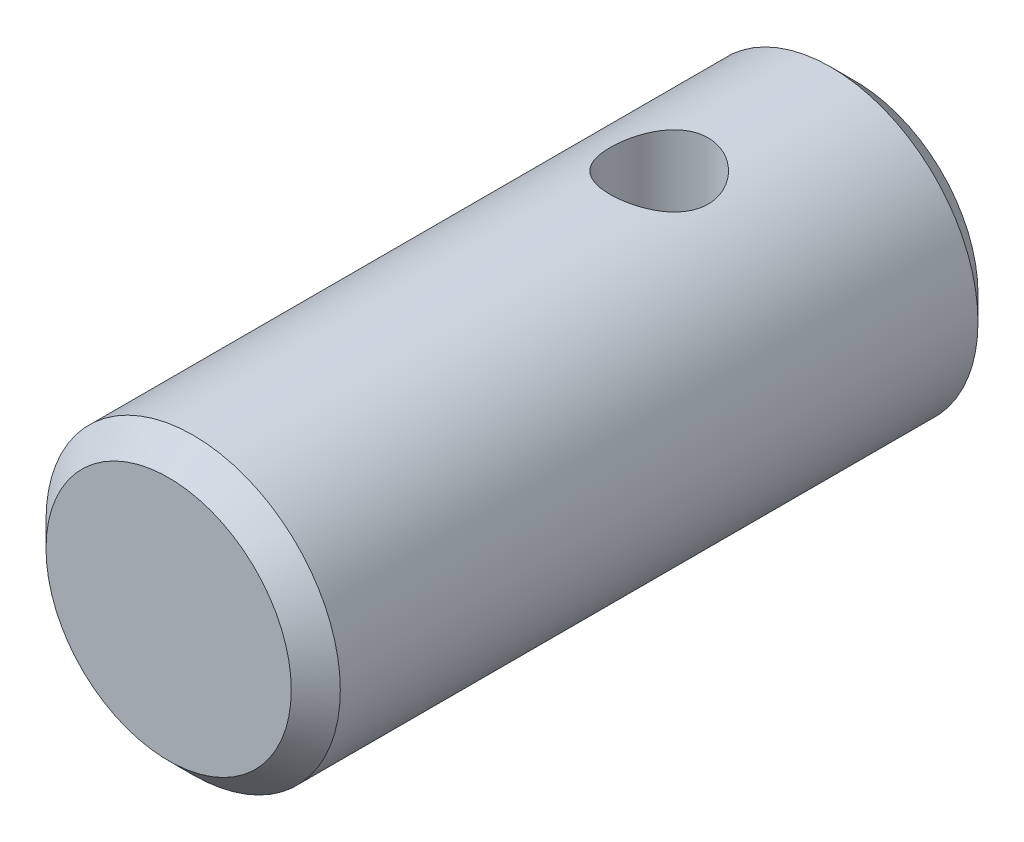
ISO-10303-21;
HEADER;
FILE_DESCRIPTION(('STEP AP214'),'2;1');
FILE_NAME('part.step','',(''),(''),'','','');
FILE_SCHEMA(('AUTOMOTIVE_DESIGN { 1 0 10303 214 1 1 1 1 }'));
ENDSEC;
DATA;
#1=APPLICATION_CONTEXT('core data for automotive mechanical design processes');
#2=APPLICATION_PROTOCOL_DEFINITION('international standard','automotive_design',2000,#1);
#3=PRODUCT_CONTEXT('',#1,'mechanical');
#4=PRODUCT('Part','Part','',(#3));
#5=PRODUCT_RELATED_PRODUCT_CATEGORY('part','',(#4));
#6=PRODUCT_DEFINITION_FORMATION('','',#4);
#7=PRODUCT_DEFINITION_CONTEXT('part definition',#1,'design');
#8=PRODUCT_DEFINITION('design','',#6,#7);
#9=PRODUCT_DEFINITION_SHAPE('','',#8);
#10=(LENGTH_UNIT() NAMED_UNIT(*) SI_UNIT(.MILLI.,.METRE.));
#11=(NAMED_UNIT(*) PLANE_ANGLE_UNIT() SI_UNIT($,.RADIAN.));
#12=(NAMED_UNIT(*) SI_UNIT($,.STERADIAN.) SOLID_ANGLE_UNIT());
#13=UNCERTAINTY_MEASURE_WITH_UNIT(LENGTH_MEASURE(1.E-05),#10,'distance_accuracy_value','');
#14=(GEOMETRIC_REPRESENTATION_CONTEXT(3) GLOBAL_UNCERTAINTY_ASSIGNED_CONTEXT((#13)) GLOBAL_UNIT_ASSIGNED_CONTEXT((#10,
#11,#12)) REPRESENTATION_CONTEXT('',''));
#15=CARTESIAN_POINT('',(0.,0.,0.));
#16=DIRECTION('',(0.,0.,1.));
#17=DIRECTION('',(1.,0.,0.));
#18=AXIS2_PLACEMENT_3D('',#15,#16,#17);
#19=CARTESIAN_POINT('',(0.,0.,7.00000000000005));
#20=DIRECTION('',(0.,0.,-1.));
#21=DIRECTION('',(-1.,0.,0.));
#22=AXIS2_PLACEMENT_3D('',#19,#20,#21);
#23=CYLINDRICAL_SURFACE('',#22,3.);
#24=CARTESIAN_POINT('',(0.,-3.,-2.00000000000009));
#25=CARTESIAN_POINT('',(0.0545633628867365,-3.00000015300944,-1.99999974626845));
#26=CARTESIAN_POINT('',(0.109125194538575,-2.99849769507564,-2.00448026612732));
#27=CARTESIAN_POINT('',(0.216641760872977,-2.99265210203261,-2.02222910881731));
#28=CARTESIAN_POINT('',(0.269596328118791,-2.98830867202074,-2.035498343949));
#29=CARTESIAN_POINT('',(0.372332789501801,-2.97725307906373,-2.07031924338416));
#30=CARTESIAN_POINT('',(0.422119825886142,-2.97054487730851,-2.09185706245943));
#31=CARTESIAN_POINT('',(0.517374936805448,-2.95544445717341,-2.14254117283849));
#32=CARTESIAN_POINT('',(0.562842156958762,-2.94705190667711,-2.17168896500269));
#33=CARTESIAN_POINT('',(0.649741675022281,-2.92914094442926,-2.23782580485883));
#34=CARTESIAN_POINT('',(0.691003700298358,-2.91959556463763,-2.27503123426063));
#35=CARTESIAN_POINT('',(0.766832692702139,-2.9006031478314,-2.35576715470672));
#36=CARTESIAN_POINT('',(0.801398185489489,-2.89115613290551,-2.39929903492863));
#37=CARTESIAN_POINT('',(0.863824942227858,-2.8731333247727,-2.49298511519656));
#38=CARTESIAN_POINT('',(0.891464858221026,-2.86459039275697,-2.54329373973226));
#39=CARTESIAN_POINT('',(0.937818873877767,-2.84975305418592,-2.64817609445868));
#40=CARTESIAN_POINT('',(0.956535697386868,-2.84345796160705,-2.70274851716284));
#41=CARTESIAN_POINT('',(0.983873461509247,-2.83411303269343,-2.81267322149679));
#42=CARTESIAN_POINT('',(0.992813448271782,-2.83096095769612,-2.86793720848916));
#43=CARTESIAN_POINT('',(1.00134112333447,-2.82795656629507,-2.97926375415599));
#44=CARTESIAN_POINT('',(1.00093170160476,-2.82810323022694,-3.0353260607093));
#45=CARTESIAN_POINT('',(0.991019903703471,-2.83159015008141,-3.1439366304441));
#46=CARTESIAN_POINT('',(0.981933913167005,-2.83478415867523,-3.19652840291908));
#47=CARTESIAN_POINT('',(0.955606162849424,-2.84376657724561,-3.2993934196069));
#48=CARTESIAN_POINT('',(0.938363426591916,-2.84955529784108,-3.34966638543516));
#49=CARTESIAN_POINT('',(0.895939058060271,-2.86317911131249,-3.44741274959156));
#50=CARTESIAN_POINT('',(0.8706340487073,-2.87104565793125,-3.49482802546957));
#51=CARTESIAN_POINT('',(0.812889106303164,-2.88792558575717,-3.58487090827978));
#52=CARTESIAN_POINT('',(0.780447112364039,-2.89693929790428,-3.62749712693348));
#53=CARTESIAN_POINT('',(0.707349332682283,-2.91567329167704,-3.70909159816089));
#54=CARTESIAN_POINT('',(0.666353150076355,-2.92540589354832,-3.74775269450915));
#55=CARTESIAN_POINT('',(0.578339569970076,-2.94406938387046,-3.81773126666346));
#56=CARTESIAN_POINT('',(0.531321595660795,-2.9530001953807,-3.84904803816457));
#57=CARTESIAN_POINT('',(0.431947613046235,-2.96917107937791,-3.90369630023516));
#58=CARTESIAN_POINT('',(0.379543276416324,-2.97639350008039,-3.92694549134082));
#59=CARTESIAN_POINT('',(0.271269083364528,-2.98820567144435,-3.96420317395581));
#60=CARTESIAN_POINT('',(0.215400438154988,-2.99279633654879,-3.97821487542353));
#61=CARTESIAN_POINT('',(0.104383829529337,-2.99867627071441,-3.99605566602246));
#62=CARTESIAN_POINT('',(0.0493095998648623,-3.00010001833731,-4.00029980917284));
#63=CARTESIAN_POINT('',(-0.0607750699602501,-2.99988902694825,-3.99966732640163));
#64=CARTESIAN_POINT('',(-0.115785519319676,-2.99825480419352,-3.99479224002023));
#65=CARTESIAN_POINT('',(-0.222519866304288,-2.99220024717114,-3.97638809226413));
#66=CARTESIAN_POINT('',(-0.274292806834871,-2.98786198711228,-3.96311379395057));
#67=CARTESIAN_POINT('',(-0.374855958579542,-2.97691846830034,-3.92860655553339));
#68=CARTESIAN_POINT('',(-0.42364578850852,-2.97031292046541,-3.90737260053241));
#69=CARTESIAN_POINT('',(-0.51828829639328,-2.95528931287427,-3.85692956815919));
#70=CARTESIAN_POINT('',(-0.564029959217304,-2.94682814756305,-3.8275254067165));
#71=CARTESIAN_POINT('',(-0.650064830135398,-2.92905253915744,-3.76180584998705));
#72=CARTESIAN_POINT('',(-0.690356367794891,-2.91973783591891,-3.72548834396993));
#73=CARTESIAN_POINT('',(-0.766252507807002,-2.9007684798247,-3.64502124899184));
#74=CARTESIAN_POINT('',(-0.80156096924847,-2.89111761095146,-3.60059077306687));
#75=CARTESIAN_POINT('',(-0.864257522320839,-2.87299973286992,-3.50622843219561));
#76=CARTESIAN_POINT('',(-0.891645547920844,-2.86453273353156,-3.45629652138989));
#77=CARTESIAN_POINT('',(-0.937596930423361,-2.84982391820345,-3.35232698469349));
#78=CARTESIAN_POINT('',(-0.95617813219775,-2.84357760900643,-3.29829792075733));
#79=CARTESIAN_POINT('',(-0.983894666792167,-2.83410832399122,-3.18762134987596));
#80=CARTESIAN_POINT('',(-0.993034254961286,-2.83088398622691,-3.13097503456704));
#81=CARTESIAN_POINT('',(-1.00127628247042,-2.8279785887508,-3.01980290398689));
#82=CARTESIAN_POINT('',(-1.00087025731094,-2.8281240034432,-2.96531765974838));
#83=CARTESIAN_POINT('',(-0.991242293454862,-2.83151269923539,-2.85723492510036));
#84=CARTESIAN_POINT('',(-0.982020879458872,-2.83475579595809,-2.80363738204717));
#85=CARTESIAN_POINT('',(-0.955371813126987,-2.84384524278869,-2.69986433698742));
#86=CARTESIAN_POINT('',(-0.938103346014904,-2.84964098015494,-2.64964317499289));
#87=CARTESIAN_POINT('',(-0.895979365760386,-2.86316398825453,-2.5527725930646));
#88=CARTESIAN_POINT('',(-0.871122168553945,-2.87089168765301,-2.50612396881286));
#89=CARTESIAN_POINT('',(-0.813260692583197,-2.88782829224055,-2.4155163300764));
#90=CARTESIAN_POINT('',(-0.779948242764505,-2.89708711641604,-2.37176349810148));
#91=CARTESIAN_POINT('',(-0.706642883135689,-2.91583356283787,-2.29031018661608));
#92=CARTESIAN_POINT('',(-0.666648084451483,-2.92532124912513,-2.25261142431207));
#93=CARTESIAN_POINT('',(-0.579241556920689,-2.94390030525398,-2.18285558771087));
#94=CARTESIAN_POINT('',(-0.531601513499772,-2.95296181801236,-2.1510756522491));
#95=CARTESIAN_POINT('',(-0.431357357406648,-2.96925991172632,-2.09600957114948));
#96=CARTESIAN_POINT('',(-0.378754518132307,-2.97649695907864,-2.07272125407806));
#97=CARTESIAN_POINT('',(-0.272493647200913,-2.9880551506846,-2.03627836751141));
#98=CARTESIAN_POINT('',(-0.218987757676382,-2.99249212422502,-2.02271753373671));
#99=CARTESIAN_POINT('',(-0.110320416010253,-2.99846407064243,-2.00457971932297));
#100=CARTESIAN_POINT('',(-0.0551594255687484,-2.99999984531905,-2.00000025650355));
#101=CARTESIAN_POINT('',(0.,-3.,-2.00000000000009));
#102=B_SPLINE_CURVE_WITH_KNOTS('',3,(#24,#25,#26,#27,#28,#29,#30,#31,#32,#33,#34,#35,#36,#37,
#38,#39,#40,#41,#42,#43,#44,#45,#46,#47,#48,#49,#50,#51,#52,#53,#54,#55,#56,#57,#58,#59,#60,#61,
#62,#63,#64,#65,#66,#67,#68,#69,#70,#71,#72,#73,#74,#75,#76,#77,#78,#79,#80,#81,#82,#83,#84,#85,
#86,#87,#88,#89,#90,#91,#92,#93,#94,#95,#96,#97,#98,#99,#100,#101),.UNSPECIFIED.,.T.,.F.,(4,2,2,
2,2,2,2,2,2,2,2,2,2,2,2,2,2,2,2,2,2,2,2,2,2,2,2,2,2,2,2,2,2,2,2,2,2,2,4),(0.,0.163487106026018,
0.326991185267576,0.490222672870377,0.65348637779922,0.821846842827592,0.990244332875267,
1.16348384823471,1.33667044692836,1.50401925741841,1.67131633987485,1.8309682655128,
1.99063930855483,2.15288171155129,2.31517102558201,2.48593305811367,2.65671145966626,
2.82918405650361,3.00159668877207,3.16653583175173,3.33144713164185,3.49158157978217,
3.65173645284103,3.81610399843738,3.98052180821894,4.15241022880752,4.32430008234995,
4.49584013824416,4.66730284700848,4.8299566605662,4.99260079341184,5.1521558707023,
5.31174638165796,5.47830066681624,5.64490211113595,5.81799660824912,5.99104681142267,
6.15636558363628,6.32163866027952),.UNSPECIFIED.);
#103=CARTESIAN_POINT('',(0.,-3.,-2.00000000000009));
#104=VERTEX_POINT('',#103);
#105=EDGE_CURVE('E10',#104,#104,#102,.T.);
#106=ORIENTED_EDGE('',*,*,#105,.T.);
#107=EDGE_LOOP('',(#106));
#108=FACE_BOUND('',#107,.T.);
#109=CARTESIAN_POINT('',(0.,3.00000000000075,-1.9999999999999));
#110=CARTESIAN_POINT('',(-0.0545633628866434,3.00000015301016,-1.99999974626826));
#111=CARTESIAN_POINT('',(-0.109125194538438,2.99849769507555,-2.00448026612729));
#112=CARTESIAN_POINT('',(-0.216641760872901,2.99265210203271,-2.0222291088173));
#113=CARTESIAN_POINT('',(-0.26959632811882,2.98830867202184,-2.03549834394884));
#114=CARTESIAN_POINT('',(-0.372332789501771,2.97725307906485,-2.07031924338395));
#115=CARTESIAN_POINT('',(-0.422119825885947,2.97054487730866,-2.09185706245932));
#116=CARTESIAN_POINT('',(-0.517374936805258,2.95544445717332,-2.1425411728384));
#117=CARTESIAN_POINT('',(-0.562842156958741,2.94705190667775,-2.17168896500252));
#118=CARTESIAN_POINT('',(-0.649741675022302,2.92914094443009,-2.23782580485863));
#119=CARTESIAN_POINT('',(-0.69100370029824,2.91959556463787,-2.27503123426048));
#120=CARTESIAN_POINT('',(-0.76683269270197,2.90060314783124,-2.35576715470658));
#121=CARTESIAN_POINT('',(-0.801398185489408,2.89115613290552,-2.39929903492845));
#122=CARTESIAN_POINT('',(-0.863824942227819,2.87313332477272,-2.49298511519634));
#123=CARTESIAN_POINT('',(-0.891464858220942,2.86459039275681,-2.54329373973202));
#124=CARTESIAN_POINT('',(-0.937818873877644,2.84975305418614,-2.64817609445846));
#125=CARTESIAN_POINT('',(-0.956535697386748,2.84345796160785,-2.70274851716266));
#126=CARTESIAN_POINT('',(-0.983873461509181,2.83411303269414,-2.81267322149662));
#127=CARTESIAN_POINT('',(-0.992813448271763,2.83096095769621,-2.86793720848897));
#128=CARTESIAN_POINT('',(-1.00134112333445,2.82795656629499,-2.97926375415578));
#129=CARTESIAN_POINT('',(-1.0009317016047,2.82810323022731,-3.03532606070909));
#130=CARTESIAN_POINT('',(-0.991019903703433,2.83159015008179,-3.14393663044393));
#131=CARTESIAN_POINT('',(-0.981933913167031,2.83478415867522,-3.19652840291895));
#132=CARTESIAN_POINT('',(-0.955606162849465,2.84376657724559,-3.29939341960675));
#133=CARTESIAN_POINT('',(-0.938363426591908,2.84955529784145,-3.34966638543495));
#134=CARTESIAN_POINT('',(-0.895939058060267,2.86317911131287,-3.4474127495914));
#135=CARTESIAN_POINT('',(-0.87063404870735,2.87104565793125,-3.49482802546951));
#136=CARTESIAN_POINT('',(-0.812889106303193,2.88792558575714,-3.5848709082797));
#137=CARTESIAN_POINT('',(-0.780447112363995,2.89693929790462,-3.62749712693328));
#138=CARTESIAN_POINT('',(-0.707349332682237,2.91567329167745,-3.7090915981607));
#139=CARTESIAN_POINT('',(-0.666353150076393,2.92540589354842,-3.74775269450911));
#140=CARTESIAN_POINT('',(-0.578339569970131,2.94406938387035,-3.81773126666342));
#141=CARTESIAN_POINT('',(-0.531321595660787,2.9530001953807,-3.84904803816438));
#142=CARTESIAN_POINT('',(-0.431947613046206,2.96917107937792,-3.90369630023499));
#143=CARTESIAN_POINT('',(-0.379543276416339,2.97639350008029,-3.92694549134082));
#144=CARTESIAN_POINT('',(-0.271269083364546,2.98820567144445,-3.96420317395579));
#145=CARTESIAN_POINT('',(-0.215400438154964,2.9927963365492,-3.97821487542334));
#146=CARTESIAN_POINT('',(-0.104383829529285,2.99867627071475,-3.99605566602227));
#147=CARTESIAN_POINT('',(-0.0493095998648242,3.0001000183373,-4.00029980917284));
#148=CARTESIAN_POINT('',(0.0607750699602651,2.99988902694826,-3.99966732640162));
#149=CARTESIAN_POINT('',(0.115785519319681,2.9982548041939,-3.99479224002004));
#150=CARTESIAN_POINT('',(0.222519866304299,2.9922002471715,-3.97638809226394));
#151=CARTESIAN_POINT('',(0.274292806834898,2.98786198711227,-3.96311379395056));
#152=CARTESIAN_POINT('',(0.374855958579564,2.97691846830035,-3.92860655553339));
#153=CARTESIAN_POINT('',(0.423645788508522,2.9703129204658,-3.90737260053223));
#154=CARTESIAN_POINT('',(0.518288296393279,2.95528931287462,-3.856929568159));
#155=CARTESIAN_POINT('',(0.564029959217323,2.94682814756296,-3.82752540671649));
#156=CARTESIAN_POINT('',(0.650064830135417,2.92905253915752,-3.76180584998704));
#157=CARTESIAN_POINT('',(0.69035636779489,2.91973783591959,-3.72548834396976));
#158=CARTESIAN_POINT('',(0.766252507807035,2.90076847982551,-3.64502124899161));
#159=CARTESIAN_POINT('',(0.801560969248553,2.89111761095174,-3.60059077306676));
#160=CARTESIAN_POINT('',(0.864257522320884,2.8729997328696,-3.50622843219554));
#161=CARTESIAN_POINT('',(0.891645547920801,2.86453273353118,-3.45629652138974));
#162=CARTESIAN_POINT('',(0.937596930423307,2.84982391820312,-3.35232698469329));
#163=CARTESIAN_POINT('',(0.956178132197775,2.84357760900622,-3.29829792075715));
#164=CARTESIAN_POINT('',(0.983894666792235,2.8341083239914,-3.1876213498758));
#165=CARTESIAN_POINT('',(0.993034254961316,2.83088398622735,-3.13097503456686));
#166=CARTESIAN_POINT('',(1.00127628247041,2.82797858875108,-3.01980290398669));
#167=CARTESIAN_POINT('',(1.00087025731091,2.82812400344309,-2.96531765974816));
#168=CARTESIAN_POINT('',(0.99124229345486,2.83151269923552,-2.85723492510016));
#169=CARTESIAN_POINT('',(0.982020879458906,2.83475579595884,-2.80363738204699));
#170=CARTESIAN_POINT('',(0.955371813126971,2.84384524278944,-2.69986433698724));
#171=CARTESIAN_POINT('',(0.938103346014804,2.84964098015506,-2.64964317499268));
#172=CARTESIAN_POINT('',(0.895979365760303,2.86316398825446,-2.55277259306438));
#173=CARTESIAN_POINT('',(0.871122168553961,2.87089168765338,-2.50612396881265));
#174=CARTESIAN_POINT('',(0.813260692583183,2.88782829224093,-2.41551633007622));
#175=CARTESIAN_POINT('',(0.779948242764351,2.89708711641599,-2.37176349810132));
#176=CARTESIAN_POINT('',(0.706642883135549,2.915833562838,-2.29031018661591));
#177=CARTESIAN_POINT('',(0.666648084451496,2.9253212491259,-2.25261142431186));
#178=CARTESIAN_POINT('',(0.579241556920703,2.94390030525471,-2.18285558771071));
#179=CARTESIAN_POINT('',(0.531601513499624,2.95296181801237,-2.15107565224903));
#180=CARTESIAN_POINT('',(0.431357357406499,2.96925991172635,-2.09600957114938));
#181=CARTESIAN_POINT('',(0.37875451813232,2.97649695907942,-2.07272125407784));
#182=CARTESIAN_POINT('',(0.272493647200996,2.98805515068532,-2.03627836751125));
#183=CARTESIAN_POINT('',(0.218987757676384,2.99249212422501,-2.02271753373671));
#184=CARTESIAN_POINT('',(0.110320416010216,2.99846407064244,-2.00457971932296));
#185=CARTESIAN_POINT('',(0.0551594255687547,2.99999984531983,-2.00000025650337));
#186=CARTESIAN_POINT('',(0.,3.00000000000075,-1.9999999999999));
#187=B_SPLINE_CURVE_WITH_KNOTS('',3,(#109,#110,#111,#112,#113,#114,#115,#116,#117,#118,#119,
#120,#121,#122,#123,#124,#125,#126,#127,#128,#129,#130,#131,#132,#133,#134,#135,#136,#137,#138,
#139,#140,#141,#142,#143,#144,#145,#146,#147,#148,#149,#150,#151,#152,#153,#154,#155,#156,#157,
#158,#159,#160,#161,#162,#163,#164,#165,#166,#167,#168,#169,#170,#171,#172,#173,#174,#175,#176,
#177,#178,#179,#180,#181,#182,#183,#184,#185,#186),.UNSPECIFIED.,.T.,.F.,(4,2,2,2,2,2,2,2,2,2,2,
2,2,2,2,2,2,2,2,2,2,2,2,2,2,2,2,2,2,2,2,2,2,2,2,2,2,2,4),(0.,0.163487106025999,
0.326991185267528,0.490222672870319,0.653486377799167,0.821846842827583,0.990244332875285,
1.16348384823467,1.33667044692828,1.50401925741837,1.67131633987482,1.83096826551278,
1.99063930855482,2.15288171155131,2.31517102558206,2.48593305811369,2.65671145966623,
2.82918405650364,3.00159668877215,3.16653583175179,3.33144713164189,3.49158157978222,
3.65173645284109,3.81610399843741,3.98052180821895,4.15241022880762,4.32430008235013,
4.49584013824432,4.66730284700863,4.82995666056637,4.99260079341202,5.15215587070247,
5.31174638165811,5.4783006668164,5.64490211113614,5.81799660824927,5.99104681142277,
6.15636558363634,6.32163866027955),.UNSPECIFIED.);
#188=CARTESIAN_POINT('',(0.,3.00000000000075,-1.9999999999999));
#189=VERTEX_POINT('',#188);
#190=EDGE_CURVE('E41',#189,#189,#187,.T.);
#191=ORIENTED_EDGE('',*,*,#190,.T.);
#192=EDGE_LOOP('',(#191));
#193=FACE_BOUND('',#192,.T.);
#194=CARTESIAN_POINT('',(0.,0.,-6.50000000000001));
#195=DIRECTION('',(0.,0.,1.));
#196=DIRECTION('',(1.,0.,0.));
#197=AXIS2_PLACEMENT_3D('',#194,#195,#196);
#198=CIRCLE('',#197,3.);
#199=CARTESIAN_POINT('',(3.,0.,-6.50000000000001));
#200=VERTEX_POINT('',#199);
#201=EDGE_CURVE('E81',#200,#200,#198,.T.);
#202=ORIENTED_EDGE('',*,*,#201,.T.);
#203=EDGE_LOOP('',(#202));
#204=FACE_BOUND('',#203,.T.);
#205=CARTESIAN_POINT('',(0.,0.,6.50000000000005));
#206=DIRECTION('',(0.,0.,1.));
#207=DIRECTION('',(1.,0.,0.));
#208=AXIS2_PLACEMENT_3D('',#205,#206,#207);
#209=CIRCLE('',#208,3.);
#210=CARTESIAN_POINT('',(3.,0.,6.50000000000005));
#211=VERTEX_POINT('',#210);
#212=EDGE_CURVE('E84',#211,#211,#209,.F.);
#213=ORIENTED_EDGE('',*,*,#212,.T.);
#214=EDGE_LOOP('',(#213));
#215=FACE_BOUND('',#214,.T.);
#216=ADVANCED_FACE('F30',(#108,#193,#204,#215),#23,.T.);
#217=CARTESIAN_POINT('',(0.,0.,7.00000000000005));
#218=DIRECTION('',(0.,0.,1.));
#219=DIRECTION('',(1.,0.,0.));
#220=AXIS2_PLACEMENT_3D('',#217,#218,#219);
#221=PLANE('',#220);
#222=CARTESIAN_POINT('',(0.,0.,7.00000000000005));
#223=DIRECTION('',(0.,0.,1.));
#224=DIRECTION('',(1.,0.,0.));
#225=AXIS2_PLACEMENT_3D('',#222,#223,#224);
#226=CIRCLE('',#225,2.5);
#227=CARTESIAN_POINT('',(2.5,0.,7.00000000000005));
#228=VERTEX_POINT('',#227);
#229=EDGE_CURVE('E45',#228,#228,#226,.T.);
#230=ORIENTED_EDGE('',*,*,#229,.T.);
#231=EDGE_LOOP('',(#230));
#232=FACE_BOUND('',#231,.T.);
#233=ADVANCED_FACE('F61',(#232),#221,.T.);
#234=CARTESIAN_POINT('',(0.,0.,-7.));
#235=DIRECTION('',(0.,0.,1.));
#236=DIRECTION('',(1.,0.,0.));
#237=AXIS2_PLACEMENT_3D('',#234,#235,#236);
#238=PLANE('',#237);
#239=CARTESIAN_POINT('',(0.,0.,-7.));
#240=DIRECTION('',(0.,0.,1.));
#241=DIRECTION('',(1.,0.,0.));
#242=AXIS2_PLACEMENT_3D('',#239,#240,#241);
#243=CIRCLE('',#242,2.5);
#244=CARTESIAN_POINT('',(2.5,0.,-7.));
#245=VERTEX_POINT('',#244);
#246=EDGE_CURVE('E49',#245,#245,#243,.F.);
#247=ORIENTED_EDGE('',*,*,#246,.T.);
#248=EDGE_LOOP('',(#247));
#249=FACE_BOUND('',#248,.T.);
#250=ADVANCED_FACE('F64',(#249),#238,.F.);
#251=CARTESIAN_POINT('',(0.,0.,-6.50000000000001));
#252=DIRECTION('',(0.,0.,1.));
#253=DIRECTION('',(1.,0.,0.));
#254=AXIS2_PLACEMENT_3D('',#251,#252,#253);
#255=CONICAL_SURFACE('',#254,3.,0.785398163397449);
#256=ORIENTED_EDGE('',*,*,#246,.F.);
#257=EDGE_LOOP('',(#256));
#258=FACE_BOUND('',#257,.T.);
#259=ORIENTED_EDGE('',*,*,#201,.F.);
#260=EDGE_LOOP('',(#259));
#261=FACE_BOUND('',#260,.T.);
#262=ADVANCED_FACE('F67',(#258,#261),#255,.T.);
#263=CARTESIAN_POINT('',(0.,0.,7.00000000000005));
#264=DIRECTION('',(0.,0.,-1.));
#265=DIRECTION('',(-1.,0.,0.));
#266=AXIS2_PLACEMENT_3D('',#263,#264,#265);
#267=CONICAL_SURFACE('',#266,2.5,0.785398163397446);
#268=ORIENTED_EDGE('',*,*,#212,.F.);
#269=EDGE_LOOP('',(#268));
#270=FACE_BOUND('',#269,.T.);
#271=ORIENTED_EDGE('',*,*,#229,.F.);
#272=EDGE_LOOP('',(#271));
#273=FACE_BOUND('',#272,.T.);
#274=ADVANCED_FACE('F32',(#270,#273),#267,.T.);
#275=CARTESIAN_POINT('',(0.,-3.,-3.00000000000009));
#276=DIRECTION('',(0.,1.,0.));
#277=DIRECTION('',(0.,0.,1.));
#278=AXIS2_PLACEMENT_3D('',#275,#276,#277);
#279=CYLINDRICAL_SURFACE('',#278,1.);
#280=ORIENTED_EDGE('',*,*,#190,.F.);
#281=EDGE_LOOP('',(#280));
#282=FACE_BOUND('',#281,.T.);
#283=ORIENTED_EDGE('',*,*,#105,.F.);
#284=EDGE_LOOP('',(#283));
#285=FACE_BOUND('',#284,.T.);
#286=ADVANCED_FACE('F56',(#282,#285),#279,.F.);
#287=CLOSED_SHELL('',(#216,#233,#250,#262,#274,#286));
#288=MANIFOLD_SOLID_BREP('B2',#287);
#289=ADVANCED_BREP_SHAPE_REPRESENTATION('',(#18,#288),#14);
#290=SHAPE_DEFINITION_REPRESENTATION(#9,#289);
ENDSEC;
END-ISO-10303-21;
